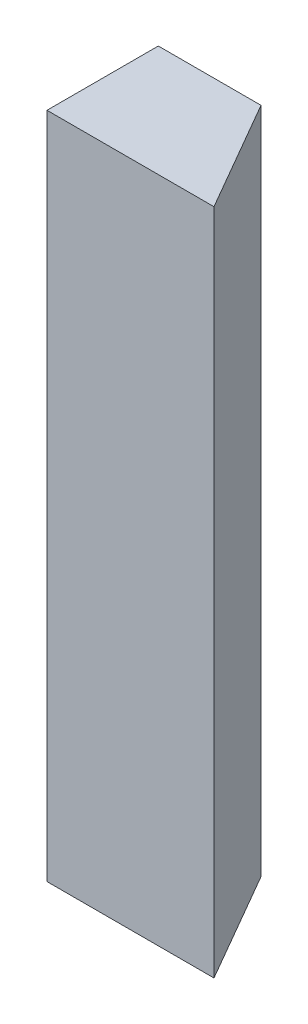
ISO-10303-21;
HEADER;
FILE_DESCRIPTION(('STEP AP214'),'2;1');
FILE_NAME('part.step','',(''),(''),'','','');
FILE_SCHEMA(('AUTOMOTIVE_DESIGN { 1 0 10303 214 1 1 1 1 }'));
ENDSEC;
DATA;
#1=APPLICATION_CONTEXT('core data for automotive mechanical design processes');
#2=APPLICATION_PROTOCOL_DEFINITION('international standard','automotive_design',2000,#1);
#3=PRODUCT_CONTEXT('',#1,'mechanical');
#4=PRODUCT('Part','Part','',(#3));
#5=PRODUCT_RELATED_PRODUCT_CATEGORY('part','',(#4));
#6=PRODUCT_DEFINITION_FORMATION('','',#4);
#7=PRODUCT_DEFINITION_CONTEXT('part definition',#1,'design');
#8=PRODUCT_DEFINITION('design','',#6,#7);
#9=PRODUCT_DEFINITION_SHAPE('','',#8);
#10=(LENGTH_UNIT() NAMED_UNIT(*) SI_UNIT(.MILLI.,.METRE.));
#11=(NAMED_UNIT(*) PLANE_ANGLE_UNIT() SI_UNIT($,.RADIAN.));
#12=(NAMED_UNIT(*) SI_UNIT($,.STERADIAN.) SOLID_ANGLE_UNIT());
#13=UNCERTAINTY_MEASURE_WITH_UNIT(LENGTH_MEASURE(1.E-05),#10,'distance_accuracy_value','');
#14=(GEOMETRIC_REPRESENTATION_CONTEXT(3) GLOBAL_UNCERTAINTY_ASSIGNED_CONTEXT((#13)) GLOBAL_UNIT_ASSIGNED_CONTEXT((#10,
#11,#12)) REPRESENTATION_CONTEXT('',''));
#15=CARTESIAN_POINT('',(0.,0.,0.));
#16=DIRECTION('',(0.,0.,1.));
#17=DIRECTION('',(1.,0.,0.));
#18=AXIS2_PLACEMENT_3D('',#15,#16,#17);
#19=CARTESIAN_POINT('',(0.,45.,15.));
#20=DIRECTION('',(0.,1.,0.));
#21=DIRECTION('',(0.,0.,1.));
#22=AXIS2_PLACEMENT_3D('',#19,#20,#21);
#23=PLANE('',#22);
#24=DIRECTION('',(0.,0.,1.));
#25=VECTOR('',#24,1.);
#26=CARTESIAN_POINT('',(0.,45.,0.));
#27=LINE('',#26,#25);
#28=CARTESIAN_POINT('',(0.,45.,0.));
#29=VERTEX_POINT('',#28);
#30=CARTESIAN_POINT('',(0.,45.,15.));
#31=VERTEX_POINT('',#30);
#32=EDGE_CURVE('E80',#29,#31,#27,.T.);
#33=ORIENTED_EDGE('',*,*,#32,.T.);
#34=DIRECTION('',(1.,0.,0.));
#35=VECTOR('',#34,1.);
#36=CARTESIAN_POINT('',(0.,45.,15.));
#37=LINE('',#36,#35);
#38=CARTESIAN_POINT('',(22.5,45.,15.));
#39=VERTEX_POINT('',#38);
#40=EDGE_CURVE('E59',#31,#39,#37,.T.);
#41=ORIENTED_EDGE('',*,*,#40,.T.);
#42=DIRECTION('',(-0.5,0.,-0.866025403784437));
#43=VECTOR('',#42,1.);
#44=CARTESIAN_POINT('',(22.5,45.,15.));
#45=LINE('',#44,#43);
#46=CARTESIAN_POINT('',(13.8397459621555,45.,0.));
#47=VERTEX_POINT('',#46);
#48=EDGE_CURVE('E83',#39,#47,#45,.T.);
#49=ORIENTED_EDGE('',*,*,#48,.T.);
#50=DIRECTION('',(-1.,0.,0.));
#51=VECTOR('',#50,1.);
#52=CARTESIAN_POINT('',(13.8397459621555,45.,0.));
#53=LINE('',#52,#51);
#54=EDGE_CURVE('E64',#47,#29,#53,.T.);
#55=ORIENTED_EDGE('',*,*,#54,.T.);
#56=EDGE_LOOP('',(#33,#41,#49,#55));
#57=FACE_BOUND('',#56,.T.);
#58=ADVANCED_FACE('F14',(#57),#23,.T.);
#59=CARTESIAN_POINT('',(22.5,30.,15.));
#60=DIRECTION('',(0.,0.,-1.));
#61=DIRECTION('',(-1.,0.,0.));
#62=AXIS2_PLACEMENT_3D('',#59,#60,#61);
#63=PLANE('',#62);
#64=DIRECTION('',(0.,-1.,0.));
#65=VECTOR('',#64,1.);
#66=CARTESIAN_POINT('',(0.,30.,15.));
#67=LINE('',#66,#65);
#68=CARTESIAN_POINT('',(0.,-45.,15.));
#69=VERTEX_POINT('',#68);
#70=EDGE_CURVE('E55',#31,#69,#67,.T.);
#71=ORIENTED_EDGE('',*,*,#70,.T.);
#72=DIRECTION('',(1.,0.,0.));
#73=VECTOR('',#72,1.);
#74=CARTESIAN_POINT('',(0.,-45.,15.));
#75=LINE('',#74,#73);
#76=CARTESIAN_POINT('',(22.5,-45.,15.));
#77=VERTEX_POINT('',#76);
#78=EDGE_CURVE('E57',#69,#77,#75,.T.);
#79=ORIENTED_EDGE('',*,*,#78,.T.);
#80=DIRECTION('',(0.,-1.,0.));
#81=VECTOR('',#80,1.);
#82=CARTESIAN_POINT('',(22.5,30.,15.));
#83=LINE('',#82,#81);
#84=EDGE_CURVE('E9',#39,#77,#83,.T.);
#85=ORIENTED_EDGE('',*,*,#84,.F.);
#86=ORIENTED_EDGE('',*,*,#40,.F.);
#87=EDGE_LOOP('',(#71,#79,#85,#86));
#88=FACE_BOUND('',#87,.T.);
#89=ADVANCED_FACE('F16',(#88),#63,.F.);
#90=CARTESIAN_POINT('',(13.8397459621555,30.,0.));
#91=DIRECTION('',(-0.866025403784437,0.,0.5));
#92=DIRECTION('',(0.5,0.,0.866025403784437));
#93=AXIS2_PLACEMENT_3D('',#90,#91,#92);
#94=PLANE('',#93);
#95=ORIENTED_EDGE('',*,*,#84,.T.);
#96=DIRECTION('',(-0.5,0.,-0.866025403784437));
#97=VECTOR('',#96,1.);
#98=CARTESIAN_POINT('',(22.5,-45.,15.));
#99=LINE('',#98,#97);
#100=CARTESIAN_POINT('',(13.8397459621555,-45.,0.));
#101=VERTEX_POINT('',#100);
#102=EDGE_CURVE('E72',#77,#101,#99,.T.);
#103=ORIENTED_EDGE('',*,*,#102,.T.);
#104=DIRECTION('',(0.,-1.,0.));
#105=VECTOR('',#104,1.);
#106=CARTESIAN_POINT('',(13.8397459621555,30.,0.));
#107=LINE('',#106,#105);
#108=EDGE_CURVE('E22',#47,#101,#107,.T.);
#109=ORIENTED_EDGE('',*,*,#108,.F.);
#110=ORIENTED_EDGE('',*,*,#48,.F.);
#111=EDGE_LOOP('',(#95,#103,#109,#110));
#112=FACE_BOUND('',#111,.T.);
#113=ADVANCED_FACE('F87',(#112),#94,.F.);
#114=CARTESIAN_POINT('',(0.,30.,0.));
#115=DIRECTION('',(0.,0.,1.));
#116=DIRECTION('',(1.,0.,0.));
#117=AXIS2_PLACEMENT_3D('',#114,#115,#116);
#118=PLANE('',#117);
#119=ORIENTED_EDGE('',*,*,#108,.T.);
#120=DIRECTION('',(-1.,0.,0.));
#121=VECTOR('',#120,1.);
#122=CARTESIAN_POINT('',(13.8397459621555,-45.,0.));
#123=LINE('',#122,#121);
#124=CARTESIAN_POINT('',(0.,-45.,0.));
#125=VERTEX_POINT('',#124);
#126=EDGE_CURVE('E78',#101,#125,#123,.T.);
#127=ORIENTED_EDGE('',*,*,#126,.T.);
#128=DIRECTION('',(0.,-1.,0.));
#129=VECTOR('',#128,1.);
#130=CARTESIAN_POINT('',(0.,30.,0.));
#131=LINE('',#130,#129);
#132=EDGE_CURVE('E29',#29,#125,#131,.T.);
#133=ORIENTED_EDGE('',*,*,#132,.F.);
#134=ORIENTED_EDGE('',*,*,#54,.F.);
#135=EDGE_LOOP('',(#119,#127,#133,#134));
#136=FACE_BOUND('',#135,.T.);
#137=ADVANCED_FACE('F86',(#136),#118,.F.);
#138=CARTESIAN_POINT('',(0.,30.,15.));
#139=DIRECTION('',(1.,0.,0.));
#140=DIRECTION('',(0.,0.,-1.));
#141=AXIS2_PLACEMENT_3D('',#138,#139,#140);
#142=PLANE('',#141);
#143=ORIENTED_EDGE('',*,*,#132,.T.);
#144=DIRECTION('',(0.,0.,1.));
#145=VECTOR('',#144,1.);
#146=CARTESIAN_POINT('',(0.,-45.,0.));
#147=LINE('',#146,#145);
#148=EDGE_CURVE('E71',#125,#69,#147,.T.);
#149=ORIENTED_EDGE('',*,*,#148,.T.);
#150=ORIENTED_EDGE('',*,*,#70,.F.);
#151=ORIENTED_EDGE('',*,*,#32,.F.);
#152=EDGE_LOOP('',(#143,#149,#150,#151));
#153=FACE_BOUND('',#152,.T.);
#154=ADVANCED_FACE('F74',(#153),#142,.F.);
#155=CARTESIAN_POINT('',(0.,-45.,15.));
#156=DIRECTION('',(0.,1.,0.));
#157=DIRECTION('',(0.,0.,1.));
#158=AXIS2_PLACEMENT_3D('',#155,#156,#157);
#159=PLANE('',#158);
#160=ORIENTED_EDGE('',*,*,#148,.F.);
#161=ORIENTED_EDGE('',*,*,#126,.F.);
#162=ORIENTED_EDGE('',*,*,#102,.F.);
#163=ORIENTED_EDGE('',*,*,#78,.F.);
#164=EDGE_LOOP('',(#160,#161,#162,#163));
#165=FACE_BOUND('',#164,.T.);
#166=ADVANCED_FACE('F69',(#165),#159,.F.);
#167=CLOSED_SHELL('',(#58,#89,#113,#137,#154,#166));
#168=MANIFOLD_SOLID_BREP('B1',#167);
#169=ADVANCED_BREP_SHAPE_REPRESENTATION('',(#18,#168),#14);
#170=SHAPE_DEFINITION_REPRESENTATION(#9,#169);
ENDSEC;
END-ISO-10303-21;
